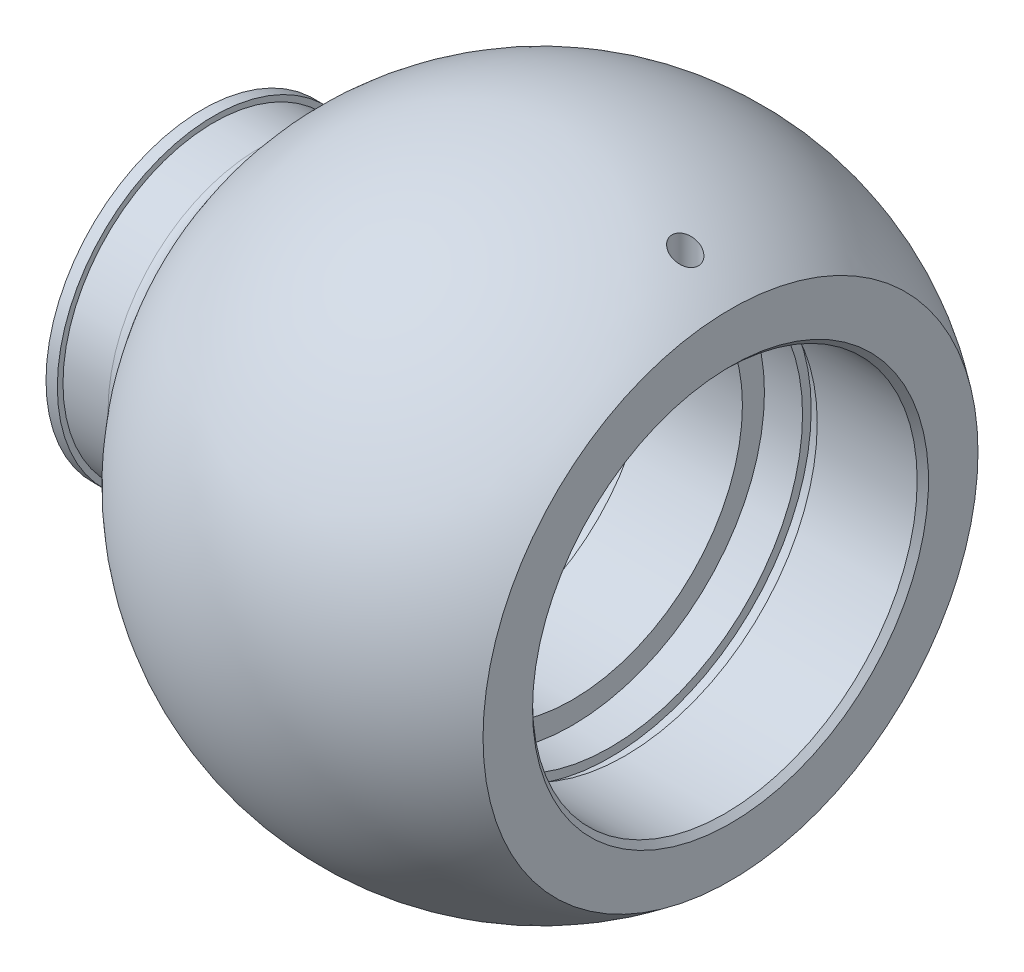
ISO-10303-21;
HEADER;
FILE_DESCRIPTION(('STEP AP214'),'2;1');
FILE_NAME('part.step','',(''),(''),'','','');
FILE_SCHEMA(('AUTOMOTIVE_DESIGN { 1 0 10303 214 1 1 1 1 }'));
ENDSEC;
DATA;
#1=APPLICATION_CONTEXT('core data for automotive mechanical design processes');
#2=APPLICATION_PROTOCOL_DEFINITION('international standard','automotive_design',2000,#1);
#3=PRODUCT_CONTEXT('',#1,'mechanical');
#4=PRODUCT('Part','Part','',(#3));
#5=PRODUCT_RELATED_PRODUCT_CATEGORY('part','',(#4));
#6=PRODUCT_DEFINITION_FORMATION('','',#4);
#7=PRODUCT_DEFINITION_CONTEXT('part definition',#1,'design');
#8=PRODUCT_DEFINITION('design','',#6,#7);
#9=PRODUCT_DEFINITION_SHAPE('','',#8);
#10=(LENGTH_UNIT() NAMED_UNIT(*) SI_UNIT(.MILLI.,.METRE.));
#11=(NAMED_UNIT(*) PLANE_ANGLE_UNIT() SI_UNIT($,.RADIAN.));
#12=(NAMED_UNIT(*) SI_UNIT($,.STERADIAN.) SOLID_ANGLE_UNIT());
#13=UNCERTAINTY_MEASURE_WITH_UNIT(LENGTH_MEASURE(1.E-05),#10,'distance_accuracy_value','');
#14=(GEOMETRIC_REPRESENTATION_CONTEXT(3) GLOBAL_UNCERTAINTY_ASSIGNED_CONTEXT((#13)) GLOBAL_UNIT_ASSIGNED_CONTEXT((#10,
#11,#12)) REPRESENTATION_CONTEXT('',''));
#15=CARTESIAN_POINT('',(0.,0.,0.));
#16=DIRECTION('',(0.,0.,1.));
#17=DIRECTION('',(1.,0.,0.));
#18=AXIS2_PLACEMENT_3D('',#15,#16,#17);
#19=CARTESIAN_POINT('',(90.,0.,0.));
#20=DIRECTION('',(-1.,0.,0.));
#21=DIRECTION('',(0.,1.,0.));
#22=AXIS2_PLACEMENT_3D('',#19,#20,#21);
#23=SPHERICAL_SURFACE('',#22,82.5);
#24=CARTESIAN_POINT('',(140.,0.,0.));
#25=DIRECTION('',(-1.,0.,0.));
#26=DIRECTION('',(0.,0.,1.));
#27=AXIS2_PLACEMENT_3D('',#24,#25,#26);
#28=CIRCLE('',#27,65.6220237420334);
#29=CARTESIAN_POINT('',(140.,0.,65.6220237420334));
#30=VERTEX_POINT('',#29);
#31=EDGE_CURVE('E122',#30,#30,#28,.T.);
#32=ORIENTED_EDGE('',*,*,#31,.T.);
#33=EDGE_LOOP('',(#32));
#34=FACE_BOUND('',#33,.T.);
#35=CARTESIAN_POINT('',(19.2464394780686,0.,0.));
#36=DIRECTION('',(-1.,0.,0.));
#37=DIRECTION('',(0.,0.,1.));
#38=AXIS2_PLACEMENT_3D('',#35,#36,#37);
#39=CIRCLE('',#38,42.4285714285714);
#40=CARTESIAN_POINT('',(19.2464394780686,0.,42.4285714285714));
#41=VERTEX_POINT('',#40);
#42=EDGE_CURVE('E10',#41,#41,#39,.T.);
#43=ORIENTED_EDGE('',*,*,#42,.F.);
#44=EDGE_LOOP('',(#43));
#45=FACE_BOUND('',#44,.T.);
#46=CARTESIAN_POINT('',(131.016095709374,71.5596026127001,-1.77571581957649));
#47=CARTESIAN_POINT('',(130.964479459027,71.587012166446,-1.86338589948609));
#48=CARTESIAN_POINT('',(130.909284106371,71.6163065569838,-1.94838180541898));
#49=CARTESIAN_POINT('',(130.792407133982,71.6782953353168,-2.11249458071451));
#50=CARTESIAN_POINT('',(130.730721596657,71.7109917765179,-2.19160784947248));
#51=CARTESIAN_POINT('',(130.536636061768,71.8137893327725,-2.41977834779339));
#52=CARTESIAN_POINT('',(130.395366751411,71.8885138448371,-2.55939889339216));
#53=CARTESIAN_POINT('',(130.095574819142,72.0468080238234,-2.81009307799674));
#54=CARTESIAN_POINT('',(129.937149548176,72.1303277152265,-2.9213168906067));
#55=CARTESIAN_POINT('',(129.607134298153,72.3039786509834,-3.11507706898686));
#56=CARTESIAN_POINT('',(129.435550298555,72.3941068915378,-3.19762637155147));
#57=CARTESIAN_POINT('',(129.066841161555,72.5873973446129,-3.33983116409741));
#58=CARTESIAN_POINT('',(128.868830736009,72.6909886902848,-3.39660830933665));
#59=CARTESIAN_POINT('',(128.467154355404,72.900667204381,-3.47471935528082));
#60=CARTESIAN_POINT('',(128.263485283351,73.0067557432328,-3.49603331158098));
#61=CARTESIAN_POINT('',(127.840478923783,73.2266108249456,-3.5032102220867));
#62=CARTESIAN_POINT('',(127.621085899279,73.3403710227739,-3.48636431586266));
#63=CARTESIAN_POINT('',(127.187657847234,73.5646014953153,-3.4115272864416));
#64=CARTESIAN_POINT('',(126.973623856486,73.6750711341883,-3.35352826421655));
#65=CARTESIAN_POINT('',(126.557333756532,73.8894721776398,-3.19657324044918));
#66=CARTESIAN_POINT('',(126.355076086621,73.9934044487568,-3.09762268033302));
#67=CARTESIAN_POINT('',(126.06629875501,74.1415117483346,-2.91952889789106));
#68=CARTESIAN_POINT('',(125.972430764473,74.1896046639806,-2.85517961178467));
#69=CARTESIAN_POINT('',(125.790500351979,74.2827310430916,-2.71682606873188));
#70=CARTESIAN_POINT('',(125.702434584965,74.3277662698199,-2.64282744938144));
#71=CARTESIAN_POINT('',(125.539615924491,74.4109587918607,-2.49156579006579));
#72=CARTESIAN_POINT('',(125.464360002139,74.4493786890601,-2.41498748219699));
#73=CARTESIAN_POINT('',(125.320526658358,74.5227570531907,-2.25433718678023));
#74=CARTESIAN_POINT('',(125.251945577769,74.5577174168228,-2.17026935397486));
#75=CARTESIAN_POINT('',(125.122298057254,74.6237659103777,-1.99516763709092));
#76=CARTESIAN_POINT('',(125.061228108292,74.6548558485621,-1.90413703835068));
#77=CARTESIAN_POINT('',(124.94740353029,74.7127711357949,-1.71573936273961));
#78=CARTESIAN_POINT('',(124.894647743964,74.7395970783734,-1.61837317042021));
#79=CARTESIAN_POINT('',(124.803904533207,74.7857187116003,-1.4298929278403));
#80=CARTESIAN_POINT('',(124.764910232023,74.8055288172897,-1.33938818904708));
#81=CARTESIAN_POINT('',(124.694500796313,74.8412871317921,-1.15474410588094));
#82=CARTESIAN_POINT('',(124.663084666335,74.8572358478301,-1.06060524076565));
#83=CARTESIAN_POINT('',(124.608265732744,74.8850585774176,-0.869491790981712));
#84=CARTESIAN_POINT('',(124.584858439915,74.8969348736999,-0.772518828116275));
#85=CARTESIAN_POINT('',(124.546364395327,74.9164628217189,-0.576517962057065));
#86=CARTESIAN_POINT('',(124.531277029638,74.9241147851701,-0.477490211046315));
#87=CARTESIAN_POINT('',(124.510682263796,74.9345592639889,-0.287860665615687));
#88=CARTESIAN_POINT('',(124.504392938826,74.9377484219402,-0.197364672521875));
#89=CARTESIAN_POINT('',(124.498861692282,74.9405531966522,-0.0160697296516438));
#90=CARTESIAN_POINT('',(124.499622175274,74.9401675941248,0.074729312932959));
#91=CARTESIAN_POINT('',(124.508188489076,74.9358237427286,0.255858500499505));
#92=CARTESIAN_POINT('',(124.51599009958,74.9318676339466,0.346188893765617));
#93=CARTESIAN_POINT('',(124.538529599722,74.920436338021,0.525764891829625));
#94=CARTESIAN_POINT('',(124.553270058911,74.9129598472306,0.615010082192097));
#95=CARTESIAN_POINT('',(124.606586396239,74.8859116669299,0.874800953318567));
#96=CARTESIAN_POINT('',(124.654548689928,74.8615737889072,1.04304178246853));
#97=CARTESIAN_POINT('',(124.77397275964,74.8009289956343,1.36852817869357));
#98=CARTESIAN_POINT('',(124.84543728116,74.7646206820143,1.52577245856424));
#99=CARTESIAN_POINT('',(125.012531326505,74.6796457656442,1.83212841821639));
#100=CARTESIAN_POINT('',(125.109034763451,74.6305318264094,1.98063855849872));
#101=CARTESIAN_POINT('',(125.321118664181,74.5224657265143,2.25926818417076));
#102=CARTESIAN_POINT('',(125.436705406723,74.4635103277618,2.38938159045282));
#103=CARTESIAN_POINT('',(125.694663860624,74.331758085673,2.64019861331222));
#104=CARTESIAN_POINT('',(125.838514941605,74.2581903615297,2.75897356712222));
#105=CARTESIAN_POINT('',(126.140373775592,74.1035598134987,2.97083132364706));
#106=CARTESIAN_POINT('',(126.298387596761,74.022493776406,3.06390304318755));
#107=CARTESIAN_POINT('',(126.642325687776,73.8457301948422,3.23221891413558));
#108=CARTESIAN_POINT('',(126.829415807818,73.7494005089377,3.30441977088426));
#109=CARTESIAN_POINT('',(127.211056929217,73.5524940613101,3.41571809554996));
#110=CARTESIAN_POINT('',(127.405611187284,73.4519154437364,3.45480093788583));
#111=CARTESIAN_POINT('',(127.815065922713,73.2397924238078,3.50170390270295));
#112=CARTESIAN_POINT('',(128.030234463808,73.1280695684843,3.50642756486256));
#113=CARTESIAN_POINT('',(128.4582145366,72.9053367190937,3.47651004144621));
#114=CARTESIAN_POINT('',(128.671025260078,72.7943269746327,3.44185575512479));
#115=CARTESIAN_POINT('',(129.095199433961,72.5725669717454,3.33165809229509));
#116=CARTESIAN_POINT('',(129.3063099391,72.4619331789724,3.25487104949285));
#117=CARTESIAN_POINT('',(129.611179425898,72.301820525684,3.10915500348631));
#118=CARTESIAN_POINT('',(129.710893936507,72.2493923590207,3.05545151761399));
#119=CARTESIAN_POINT('',(129.905516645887,72.1469565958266,2.9380094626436));
#120=CARTESIAN_POINT('',(130.000427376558,72.0969477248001,2.87427625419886));
#121=CARTESIAN_POINT('',(130.179974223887,72.0022506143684,2.74037186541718));
#122=CARTESIAN_POINT('',(130.26488591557,71.957421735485,2.67066916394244));
#123=CARTESIAN_POINT('',(130.428585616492,71.8709215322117,2.52272327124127));
#124=CARTESIAN_POINT('',(130.50737703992,71.8292484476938,2.44448490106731));
#125=CARTESIAN_POINT('',(130.657938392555,71.7495524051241,2.27986865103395));
#126=CARTESIAN_POINT('',(130.729710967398,71.7115280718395,2.19349386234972));
#127=CARTESIAN_POINT('',(130.865321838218,71.6396317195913,2.01312091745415));
#128=CARTESIAN_POINT('',(130.929161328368,71.6057590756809,1.91912391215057));
#129=CARTESIAN_POINT('',(131.041171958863,71.5462906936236,1.73536513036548));
#130=CARTESIAN_POINT('',(131.090300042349,71.5201913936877,1.64634859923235));
#131=CARTESIAN_POINT('',(131.180970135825,71.4720004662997,1.46350193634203));
#132=CARTESIAN_POINT('',(131.222513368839,71.4499081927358,1.36967258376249));
#133=CARTESIAN_POINT('',(131.297408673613,71.4100646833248,1.17799626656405));
#134=CARTESIAN_POINT('',(131.330767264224,71.3923099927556,1.08015257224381));
#135=CARTESIAN_POINT('',(131.388830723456,71.3613978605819,0.881225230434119));
#136=CARTESIAN_POINT('',(131.413536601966,71.3482398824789,0.780141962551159));
#137=CARTESIAN_POINT('',(131.451509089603,71.3280127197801,0.587812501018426));
#138=CARTESIAN_POINT('',(131.465784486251,71.3204066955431,0.496820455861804));
#139=CARTESIAN_POINT('',(131.487130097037,71.3090327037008,0.313721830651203));
#140=CARTESIAN_POINT('',(131.494197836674,71.3052660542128,0.221614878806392));
#141=CARTESIAN_POINT('',(131.501020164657,71.301630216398,0.0370840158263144));
#142=CARTESIAN_POINT('',(131.500777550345,71.3017595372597,-0.0553397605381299));
#143=CARTESIAN_POINT('',(131.492997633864,71.3059056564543,-0.239802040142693));
#144=CARTESIAN_POINT('',(131.485457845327,71.3099237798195,-0.331840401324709));
#145=CARTESIAN_POINT('',(131.453252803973,71.3270841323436,-0.596014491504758));
#146=CARTESIAN_POINT('',(131.419330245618,71.3451576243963,-0.766803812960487));
#147=CARTESIAN_POINT('',(131.327297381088,71.3941593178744,-1.09948010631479));
#148=CARTESIAN_POINT('',(131.269222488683,71.4250686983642,-1.26137972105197));
#149=CARTESIAN_POINT('',(131.172953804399,71.4762598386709,-1.47883916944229));
#150=CARTESIAN_POINT('',(131.143842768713,71.4917352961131,-1.53973432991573));
#151=CARTESIAN_POINT('',(131.082367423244,71.524403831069,-1.65937596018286));
#152=CARTESIAN_POINT('',(131.050003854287,71.5415965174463,-1.71812291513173));
#153=CARTESIAN_POINT('',(131.016095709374,71.5596026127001,-1.77571581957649));
#154=B_SPLINE_CURVE_WITH_KNOTS('',3,(#46,#47,#48,#49,#50,#51,#52,#53,#54,#55,#56,#57,#58,#59,
#60,#61,#62,#63,#64,#65,#66,#67,#68,#69,#70,#71,#72,#73,#74,#75,#76,#77,#78,#79,#80,#81,#82,#83,
#84,#85,#86,#87,#88,#89,#90,#91,#92,#93,#94,#95,#96,#97,#98,#99,#100,#101,#102,#103,#104,#105,
#106,#107,#108,#109,#110,#111,#112,#113,#114,#115,#116,#117,#118,#119,#120,#121,#122,#123,#124,
#125,#126,#127,#128,#129,#130,#131,#132,#133,#134,#135,#136,#137,#138,#139,#140,#141,#142,#143,
#144,#145,#146,#147,#148,#149,#150,#151,#152,#153),.UNSPECIFIED.,.T.,.F.,(4,2,2,2,2,2,2,2,2,2,2,
2,2,2,2,2,2,2,2,2,2,2,2,2,2,2,2,2,2,2,2,2,2,2,2,2,2,2,2,2,2,2,2,2,2,2,2,2,2,2,2,2,2,4),(0.,
0.31600930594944,0.632210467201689,1.26556786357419,1.89550298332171,2.5251535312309,
3.21394074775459,3.90311520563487,4.64273083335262,5.38248846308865,6.12214782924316,
6.49235190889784,6.86234065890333,7.20397595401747,7.54542289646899,7.88670971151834,
8.22794897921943,8.52909927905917,8.83020999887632,9.13115165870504,9.43207110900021,
9.70404403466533,9.97610972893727,10.2480124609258,10.520015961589,11.0472940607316,
11.5746337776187,12.123688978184,12.6729251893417,13.27205724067,13.8714472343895,
14.5360811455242,15.2010084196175,15.9251925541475,16.649617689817,17.3966759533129,
17.7706630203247,18.1444508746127,18.4999232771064,18.8551959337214,19.2103341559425,
19.5654188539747,19.8798904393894,20.1943112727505,20.508480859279,20.8226137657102,
21.0995129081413,21.3765070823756,21.6533952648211,21.9303778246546,22.4529767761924,
22.9748121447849,23.1824546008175,23.3900498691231),.UNSPECIFIED.);
#155=CARTESIAN_POINT('',(131.016095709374,71.5596026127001,-1.77571581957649));
#156=VERTEX_POINT('',#155);
#157=EDGE_CURVE('E125',#156,#156,#154,.T.);
#158=ORIENTED_EDGE('',*,*,#157,.F.);
#159=EDGE_LOOP('',(#158));
#160=FACE_BOUND('',#159,.T.);
#161=ADVANCED_FACE('F32',(#34,#45,#160),#23,.T.);
#162=CARTESIAN_POINT('',(-14.501348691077,0.,0.));
#163=DIRECTION('',(-1.,0.,0.));
#164=DIRECTION('',(0.,0.,1.));
#165=AXIS2_PLACEMENT_3D('',#162,#163,#164);
#166=CYLINDRICAL_SURFACE('',#165,51.);
#167=CARTESIAN_POINT('',(112.,0.,0.));
#168=DIRECTION('',(-1.,0.,0.));
#169=DIRECTION('',(0.,0.,1.));
#170=AXIS2_PLACEMENT_3D('',#167,#168,#169);
#171=CIRCLE('',#170,51.);
#172=CARTESIAN_POINT('',(112.,0.,51.));
#173=VERTEX_POINT('',#172);
#174=EDGE_CURVE('E113',#173,#173,#171,.T.);
#175=ORIENTED_EDGE('',*,*,#174,.T.);
#176=EDGE_LOOP('',(#175));
#177=FACE_BOUND('',#176,.T.);
#178=CARTESIAN_POINT('',(138.5,0.,0.));
#179=DIRECTION('',(-1.,0.,0.));
#180=DIRECTION('',(0.,0.,1.));
#181=AXIS2_PLACEMENT_3D('',#178,#179,#180);
#182=CIRCLE('',#181,51.);
#183=CARTESIAN_POINT('',(138.5,0.,51.));
#184=VERTEX_POINT('',#183);
#185=EDGE_CURVE('E116',#184,#184,#182,.T.);
#186=ORIENTED_EDGE('',*,*,#185,.F.);
#187=EDGE_LOOP('',(#186));
#188=FACE_BOUND('',#187,.T.);
#189=CARTESIAN_POINT('',(128.,50.8797602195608,-3.49999999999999));
#190=CARTESIAN_POINT('',(128.196348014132,50.8797618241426,-3.4999913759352));
#191=CARTESIAN_POINT('',(128.392832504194,50.8809090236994,-3.48342194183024));
#192=CARTESIAN_POINT('',(128.780373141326,50.8853742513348,-3.41756267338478));
#193=CARTESIAN_POINT('',(128.971422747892,50.8886947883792,-3.36823502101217));
#194=CARTESIAN_POINT('',(129.342424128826,50.8971288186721,-3.23828544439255));
#195=CARTESIAN_POINT('',(129.522381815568,50.9022413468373,-3.15768036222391));
#196=CARTESIAN_POINT('',(129.866167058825,50.913682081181,-2.96749200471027));
#197=CARTESIAN_POINT('',(130.029998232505,50.920010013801,-2.85791524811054));
#198=CARTESIAN_POINT('',(130.337218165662,50.9331812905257,-2.61268079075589));
#199=CARTESIAN_POINT('',(130.480574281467,50.9400254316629,-2.476982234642));
#200=CARTESIAN_POINT('',(130.742495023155,50.9534505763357,-2.18344124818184));
#201=CARTESIAN_POINT('',(130.861058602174,50.9600315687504,-2.02559788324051));
#202=CARTESIAN_POINT('',(131.070131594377,50.9721959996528,-1.6920603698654));
#203=CARTESIAN_POINT('',(131.160613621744,50.9777784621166,-1.51634901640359));
#204=CARTESIAN_POINT('',(131.310779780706,50.9873083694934,-1.15218380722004));
#205=CARTESIAN_POINT('',(131.370464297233,50.9912558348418,-0.963730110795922));
#206=CARTESIAN_POINT('',(131.457249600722,50.9970654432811,-0.579747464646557));
#207=CARTESIAN_POINT('',(131.484402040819,50.998930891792,-0.384230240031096));
#208=CARTESIAN_POINT('',(131.505511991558,51.0003774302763,0.00859501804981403));
#209=CARTESIAN_POINT('',(131.49946994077,50.9999585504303,0.205903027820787));
#210=CARTESIAN_POINT('',(131.454404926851,50.9968863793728,0.596359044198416));
#211=CARTESIAN_POINT('',(131.415437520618,50.9942368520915,0.789513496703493));
#212=CARTESIAN_POINT('',(131.30571419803,50.9870059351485,1.16653342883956));
#213=CARTESIAN_POINT('',(131.234958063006,50.9824245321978,1.35039884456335));
#214=CARTESIAN_POINT('',(131.063603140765,50.9718391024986,1.70379937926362));
#215=CARTESIAN_POINT('',(130.962979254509,50.9658338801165,1.87332229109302));
#216=CARTESIAN_POINT('',(130.734763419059,50.9530763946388,2.19309239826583));
#217=CARTESIAN_POINT('',(130.607171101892,50.9463241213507,2.34333933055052));
#218=CARTESIAN_POINT('',(130.328326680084,50.9328157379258,2.62061693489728));
#219=CARTESIAN_POINT('',(130.17702633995,50.9260596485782,2.74759910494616));
#220=CARTESIAN_POINT('',(129.855229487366,50.9133192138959,2.97436847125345));
#221=CARTESIAN_POINT('',(129.684732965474,50.9073348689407,3.07415565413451));
#222=CARTESIAN_POINT('',(129.329351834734,50.8968139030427,3.24369942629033));
#223=CARTESIAN_POINT('',(129.144466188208,50.8922773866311,3.31345384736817));
#224=CARTESIAN_POINT('',(128.765569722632,50.8851672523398,3.42091789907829));
#225=CARTESIAN_POINT('',(128.571559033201,50.8825936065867,3.45862798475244));
#226=CARTESIAN_POINT('',(128.180343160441,50.8797047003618,3.50087223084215));
#227=CARTESIAN_POINT('',(127.983145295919,50.8793848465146,3.50547386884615));
#228=CARTESIAN_POINT('',(127.590780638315,50.8810275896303,3.48154701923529));
#229=CARTESIAN_POINT('',(127.395613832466,50.8829901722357,3.45301874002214));
#230=CARTESIAN_POINT('',(127.013042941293,50.8889724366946,3.36369797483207));
#231=CARTESIAN_POINT('',(126.825631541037,50.8929901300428,3.30293667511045));
#232=CARTESIAN_POINT('',(126.463665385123,50.9026282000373,3.15090627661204));
#233=CARTESIAN_POINT('',(126.289110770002,50.9082485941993,3.05963684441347));
#234=CARTESIAN_POINT('',(125.957503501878,50.9204698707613,2.84900899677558));
#235=CARTESIAN_POINT('',(125.800479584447,50.9270723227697,2.72960543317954));
#236=CARTESIAN_POINT('',(125.508680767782,50.940508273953,2.46616432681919));
#237=CARTESIAN_POINT('',(125.373906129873,50.9473417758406,2.32212649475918));
#238=CARTESIAN_POINT('',(125.130203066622,50.9604833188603,2.01321482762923));
#239=CARTESIAN_POINT('',(125.02131835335,50.9667904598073,1.84830646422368));
#240=CARTESIAN_POINT('',(124.832785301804,50.9781556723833,1.5025080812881));
#241=CARTESIAN_POINT('',(124.753136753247,50.9832137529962,1.32161817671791));
#242=CARTESIAN_POINT('',(124.625412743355,50.9915066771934,0.949151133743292));
#243=CARTESIAN_POINT('',(124.577309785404,50.9947431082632,0.757583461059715));
#244=CARTESIAN_POINT('',(124.513952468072,50.9990344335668,0.369067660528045));
#245=CARTESIAN_POINT('',(124.498697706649,51.0000893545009,0.172119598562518));
#246=CARTESIAN_POINT('',(124.501473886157,50.9998988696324,-0.221134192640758));
#247=CARTESIAN_POINT('',(124.519436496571,50.99865818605,-0.417440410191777));
#248=CARTESIAN_POINT('',(124.587995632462,50.9940253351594,-0.804242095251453));
#249=CARTESIAN_POINT('',(124.638592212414,50.9906331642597,-0.994737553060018));
#250=CARTESIAN_POINT('',(124.770967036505,50.9820784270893,-1.36451883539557));
#251=CARTESIAN_POINT('',(124.852744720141,50.9769158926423,-1.54380486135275));
#252=CARTESIAN_POINT('',(125.045151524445,50.9653995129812,-1.88611201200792));
#253=CARTESIAN_POINT('',(125.155779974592,50.9590456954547,-2.04913351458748));
#254=CARTESIAN_POINT('',(125.403002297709,50.9458455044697,-2.35463189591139));
#255=CARTESIAN_POINT('',(125.539646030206,50.9389982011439,-2.4970683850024));
#256=CARTESIAN_POINT('',(125.83494427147,50.9255904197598,-2.75703335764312));
#257=CARTESIAN_POINT('',(125.993604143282,50.9190300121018,-2.8745557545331));
#258=CARTESIAN_POINT('',(126.328645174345,50.9069286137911,-3.08146221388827));
#259=CARTESIAN_POINT('',(126.505050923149,50.9013890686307,-3.17080650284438));
#260=CARTESIAN_POINT('',(126.870271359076,50.8919748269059,-3.31849754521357));
#261=CARTESIAN_POINT('',(127.059071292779,50.8880981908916,-3.37688042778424));
#262=CARTESIAN_POINT('',(127.374179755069,50.8834596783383,-3.44589738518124));
#263=CARTESIAN_POINT('',(127.498453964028,50.8820786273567,-3.46615943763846));
#264=CARTESIAN_POINT('',(127.748466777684,50.880228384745,-3.49321349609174));
#265=CARTESIAN_POINT('',(127.87420537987,50.8797591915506,-3.50000552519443));
#266=CARTESIAN_POINT('',(128.,50.8797602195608,-3.49999999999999));
#267=B_SPLINE_CURVE_WITH_KNOTS('',3,(#189,#190,#191,#192,#193,#194,#195,#196,#197,#198,#199,
#200,#201,#202,#203,#204,#205,#206,#207,#208,#209,#210,#211,#212,#213,#214,#215,#216,#217,#218,
#219,#220,#221,#222,#223,#224,#225,#226,#227,#228,#229,#230,#231,#232,#233,#234,#235,#236,#237,
#238,#239,#240,#241,#242,#243,#244,#245,#246,#247,#248,#249,#250,#251,#252,#253,#254,#255,#256,
#257,#258,#259,#260,#261,#262,#263,#264,#265,#266),.UNSPECIFIED.,.T.,.F.,(4,2,2,2,2,2,2,2,2,2,2,
2,2,2,2,2,2,2,2,2,2,2,2,2,2,2,2,2,2,2,2,2,2,2,2,2,2,2,4),(0.,0.588584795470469,1.1778502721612,
1.76679888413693,2.35561509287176,2.94535982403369,3.53512945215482,4.12547244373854,
4.71580805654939,5.30520511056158,5.89459437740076,6.482991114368,7.07139189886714,
7.66028854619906,8.24919322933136,8.83931201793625,9.429431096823,10.0195927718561,
10.6097460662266,11.1986962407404,11.7876427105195,12.3760203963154,12.9644045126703,
13.5537393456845,14.1430811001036,14.7334109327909,15.3237365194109,15.9135468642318,
16.5033499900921,17.0919411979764,17.6805333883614,18.269114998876,18.8576829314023,
19.4473904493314,20.0372418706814,20.6279221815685,21.2179116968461,21.5950019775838,
21.9720916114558),.UNSPECIFIED.);
#268=CARTESIAN_POINT('',(128.,50.8797602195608,-3.49999999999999));
#269=VERTEX_POINT('',#268);
#270=EDGE_CURVE('E36',#269,#269,#267,.T.);
#271=ORIENTED_EDGE('',*,*,#270,.F.);
#272=EDGE_LOOP('',(#271));
#273=FACE_BOUND('',#272,.T.);
#274=ADVANCED_FACE('F143',(#177,#188,#273),#166,.F.);
#275=CARTESIAN_POINT('',(14.9583449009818,0.,0.));
#276=DIRECTION('',(-1.,0.,0.));
#277=DIRECTION('',(0.,0.,1.));
#278=AXIS2_PLACEMENT_3D('',#275,#276,#277);
#279=TOROIDAL_SURFACE('',#278,45.,5.);
#280=CARTESIAN_POINT('',(14.9583449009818,0.,0.));
#281=DIRECTION('',(-1.,0.,0.));
#282=DIRECTION('',(0.,0.,1.));
#283=AXIS2_PLACEMENT_3D('',#280,#281,#282);
#284=CIRCLE('',#283,40.);
#285=CARTESIAN_POINT('',(14.9583449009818,0.,40.));
#286=VERTEX_POINT('',#285);
#287=EDGE_CURVE('E44',#286,#286,#284,.T.);
#288=ORIENTED_EDGE('',*,*,#287,.F.);
#289=EDGE_LOOP('',(#288));
#290=FACE_BOUND('',#289,.T.);
#291=ORIENTED_EDGE('',*,*,#42,.T.);
#292=EDGE_LOOP('',(#291));
#293=FACE_BOUND('',#292,.T.);
#294=ADVANCED_FACE('F147',(#290,#293),#279,.F.);
#295=CARTESIAN_POINT('',(-14.501348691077,0.,0.));
#296=DIRECTION('',(-1.,0.,0.));
#297=DIRECTION('',(0.,0.,1.));
#298=AXIS2_PLACEMENT_3D('',#295,#296,#297);
#299=CYLINDRICAL_SURFACE('',#298,40.);
#300=CARTESIAN_POINT('',(3.,0.,0.));
#301=DIRECTION('',(-1.,0.,0.));
#302=DIRECTION('',(0.,0.,1.));
#303=AXIS2_PLACEMENT_3D('',#300,#301,#302);
#304=CIRCLE('',#303,40.);
#305=CARTESIAN_POINT('',(3.,0.,40.));
#306=VERTEX_POINT('',#305);
#307=EDGE_CURVE('E48',#306,#306,#304,.T.);
#308=ORIENTED_EDGE('',*,*,#307,.F.);
#309=EDGE_LOOP('',(#308));
#310=FACE_BOUND('',#309,.T.);
#311=ORIENTED_EDGE('',*,*,#287,.T.);
#312=EDGE_LOOP('',(#311));
#313=FACE_BOUND('',#312,.T.);
#314=ADVANCED_FACE('F231',(#310,#313),#299,.T.);
#315=CARTESIAN_POINT('',(3.,41.5,0.));
#316=DIRECTION('',(-1.,0.,0.));
#317=DIRECTION('',(0.,0.,1.));
#318=AXIS2_PLACEMENT_3D('',#315,#316,#317);
#319=PLANE('',#318);
#320=CARTESIAN_POINT('',(3.,0.,0.));
#321=DIRECTION('',(-1.,0.,0.));
#322=DIRECTION('',(0.,0.,1.));
#323=AXIS2_PLACEMENT_3D('',#320,#321,#322);
#324=CIRCLE('',#323,41.5);
#325=CARTESIAN_POINT('',(3.,0.,41.5));
#326=VERTEX_POINT('',#325);
#327=EDGE_CURVE('E53',#326,#326,#324,.T.);
#328=ORIENTED_EDGE('',*,*,#327,.F.);
#329=EDGE_LOOP('',(#328));
#330=FACE_BOUND('',#329,.T.);
#331=ORIENTED_EDGE('',*,*,#307,.T.);
#332=EDGE_LOOP('',(#331));
#333=FACE_BOUND('',#332,.T.);
#334=ADVANCED_FACE('F227',(#330,#333),#319,.F.);
#335=CARTESIAN_POINT('',(-14.501348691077,0.,0.));
#336=DIRECTION('',(-1.,0.,0.));
#337=DIRECTION('',(0.,0.,1.));
#338=AXIS2_PLACEMENT_3D('',#335,#336,#337);
#339=CYLINDRICAL_SURFACE('',#338,41.5);
#340=CARTESIAN_POINT('',(0.,0.,0.));
#341=DIRECTION('',(-1.,0.,0.));
#342=DIRECTION('',(0.,0.,1.));
#343=AXIS2_PLACEMENT_3D('',#340,#341,#342);
#344=CIRCLE('',#343,41.5);
#345=CARTESIAN_POINT('',(0.,0.,41.5));
#346=VERTEX_POINT('',#345);
#347=EDGE_CURVE('E56',#346,#346,#344,.T.);
#348=ORIENTED_EDGE('',*,*,#347,.F.);
#349=EDGE_LOOP('',(#348));
#350=FACE_BOUND('',#349,.T.);
#351=ORIENTED_EDGE('',*,*,#327,.T.);
#352=EDGE_LOOP('',(#351));
#353=FACE_BOUND('',#352,.T.);
#354=ADVANCED_FACE('F223',(#350,#353),#339,.T.);
#355=CARTESIAN_POINT('',(0.,41.5,0.));
#356=DIRECTION('',(1.,0.,0.));
#357=DIRECTION('',(0.,0.,-1.));
#358=AXIS2_PLACEMENT_3D('',#355,#356,#357);
#359=PLANE('',#358);
#360=CARTESIAN_POINT('',(0.,0.,0.));
#361=DIRECTION('',(-1.,0.,0.));
#362=DIRECTION('',(0.,0.,1.));
#363=AXIS2_PLACEMENT_3D('',#360,#361,#362);
#364=CIRCLE('',#363,27.75);
#365=CARTESIAN_POINT('',(0.,0.,27.75));
#366=VERTEX_POINT('',#365);
#367=EDGE_CURVE('E59',#366,#366,#364,.T.);
#368=ORIENTED_EDGE('',*,*,#367,.F.);
#369=EDGE_LOOP('',(#368));
#370=FACE_BOUND('',#369,.T.);
#371=ORIENTED_EDGE('',*,*,#347,.T.);
#372=EDGE_LOOP('',(#371));
#373=FACE_BOUND('',#372,.T.);
#374=ADVANCED_FACE('F219',(#370,#373),#359,.F.);
#375=CARTESIAN_POINT('',(-14.501348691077,0.,0.));
#376=DIRECTION('',(-1.,0.,0.));
#377=DIRECTION('',(0.,0.,1.));
#378=AXIS2_PLACEMENT_3D('',#375,#376,#377);
#379=CYLINDRICAL_SURFACE('',#378,27.75);
#380=CARTESIAN_POINT('',(2.,0.,0.));
#381=DIRECTION('',(-1.,0.,0.));
#382=DIRECTION('',(0.,0.,1.));
#383=AXIS2_PLACEMENT_3D('',#380,#381,#382);
#384=CIRCLE('',#383,27.75);
#385=CARTESIAN_POINT('',(2.,0.,27.75));
#386=VERTEX_POINT('',#385);
#387=EDGE_CURVE('E62',#386,#386,#384,.T.);
#388=ORIENTED_EDGE('',*,*,#387,.F.);
#389=EDGE_LOOP('',(#388));
#390=FACE_BOUND('',#389,.T.);
#391=ORIENTED_EDGE('',*,*,#367,.T.);
#392=EDGE_LOOP('',(#391));
#393=FACE_BOUND('',#392,.T.);
#394=ADVANCED_FACE('F215',(#390,#393),#379,.F.);
#395=CARTESIAN_POINT('',(2.,27.75,0.));
#396=DIRECTION('',(-1.,0.,0.));
#397=DIRECTION('',(0.,0.,1.));
#398=AXIS2_PLACEMENT_3D('',#395,#396,#397);
#399=PLANE('',#398);
#400=CARTESIAN_POINT('',(2.,0.,0.));
#401=DIRECTION('',(-1.,0.,0.));
#402=DIRECTION('',(0.,0.,1.));
#403=AXIS2_PLACEMENT_3D('',#400,#401,#402);
#404=CIRCLE('',#403,29.);
#405=CARTESIAN_POINT('',(2.,0.,29.));
#406=VERTEX_POINT('',#405);
#407=EDGE_CURVE('E65',#406,#406,#404,.T.);
#408=ORIENTED_EDGE('',*,*,#407,.F.);
#409=EDGE_LOOP('',(#408));
#410=FACE_BOUND('',#409,.T.);
#411=ORIENTED_EDGE('',*,*,#387,.T.);
#412=EDGE_LOOP('',(#411));
#413=FACE_BOUND('',#412,.T.);
#414=ADVANCED_FACE('F211',(#410,#413),#399,.F.);
#415=CARTESIAN_POINT('',(-14.501348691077,0.,0.));
#416=DIRECTION('',(-1.,0.,0.));
#417=DIRECTION('',(0.,0.,1.));
#418=AXIS2_PLACEMENT_3D('',#415,#416,#417);
#419=CYLINDRICAL_SURFACE('',#418,29.);
#420=CARTESIAN_POINT('',(6.99999999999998,0.,0.));
#421=DIRECTION('',(-1.,0.,0.));
#422=DIRECTION('',(0.,0.,1.));
#423=AXIS2_PLACEMENT_3D('',#420,#421,#422);
#424=CIRCLE('',#423,29.);
#425=CARTESIAN_POINT('',(6.99999999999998,0.,29.));
#426=VERTEX_POINT('',#425);
#427=EDGE_CURVE('E68',#426,#426,#424,.T.);
#428=ORIENTED_EDGE('',*,*,#427,.F.);
#429=EDGE_LOOP('',(#428));
#430=FACE_BOUND('',#429,.T.);
#431=ORIENTED_EDGE('',*,*,#407,.T.);
#432=EDGE_LOOP('',(#431));
#433=FACE_BOUND('',#432,.T.);
#434=ADVANCED_FACE('F207',(#430,#433),#419,.F.);
#435=CARTESIAN_POINT('',(6.99999999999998,25.,0.));
#436=DIRECTION('',(1.,0.,0.));
#437=DIRECTION('',(0.,0.,-1.));
#438=AXIS2_PLACEMENT_3D('',#435,#436,#437);
#439=PLANE('',#438);
#440=CARTESIAN_POINT('',(6.99999999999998,0.,0.));
#441=DIRECTION('',(-1.,0.,0.));
#442=DIRECTION('',(0.,0.,1.));
#443=AXIS2_PLACEMENT_3D('',#440,#441,#442);
#444=CIRCLE('',#443,25.);
#445=CARTESIAN_POINT('',(6.99999999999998,0.,25.));
#446=VERTEX_POINT('',#445);
#447=EDGE_CURVE('E71',#446,#446,#444,.T.);
#448=ORIENTED_EDGE('',*,*,#447,.F.);
#449=EDGE_LOOP('',(#448));
#450=FACE_BOUND('',#449,.T.);
#451=ORIENTED_EDGE('',*,*,#427,.T.);
#452=EDGE_LOOP('',(#451));
#453=FACE_BOUND('',#452,.T.);
#454=ADVANCED_FACE('F203',(#450,#453),#439,.F.);
#455=CARTESIAN_POINT('',(-14.501348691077,0.,0.));
#456=DIRECTION('',(-1.,0.,0.));
#457=DIRECTION('',(0.,0.,1.));
#458=AXIS2_PLACEMENT_3D('',#455,#456,#457);
#459=CYLINDRICAL_SURFACE('',#458,25.);
#460=CARTESIAN_POINT('',(12.,0.,0.));
#461=DIRECTION('',(-1.,0.,0.));
#462=DIRECTION('',(0.,0.,1.));
#463=AXIS2_PLACEMENT_3D('',#460,#461,#462);
#464=CIRCLE('',#463,25.);
#465=CARTESIAN_POINT('',(12.,0.,25.));
#466=VERTEX_POINT('',#465);
#467=EDGE_CURVE('E74',#466,#466,#464,.T.);
#468=ORIENTED_EDGE('',*,*,#467,.F.);
#469=EDGE_LOOP('',(#468));
#470=FACE_BOUND('',#469,.T.);
#471=ORIENTED_EDGE('',*,*,#447,.T.);
#472=EDGE_LOOP('',(#471));
#473=FACE_BOUND('',#472,.T.);
#474=ADVANCED_FACE('F199',(#470,#473),#459,.F.);
#475=CARTESIAN_POINT('',(12.,30.,0.));
#476=DIRECTION('',(-1.,0.,0.));
#477=DIRECTION('',(0.,0.,1.));
#478=AXIS2_PLACEMENT_3D('',#475,#476,#477);
#479=PLANE('',#478);
#480=CARTESIAN_POINT('',(12.0000000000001,0.,0.));
#481=DIRECTION('',(-1.,0.,0.));
#482=DIRECTION('',(0.,0.,1.));
#483=AXIS2_PLACEMENT_3D('',#480,#481,#482);
#484=CIRCLE('',#483,30.);
#485=CARTESIAN_POINT('',(12.0000000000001,0.,30.));
#486=VERTEX_POINT('',#485);
#487=EDGE_CURVE('E77',#486,#486,#484,.T.);
#488=ORIENTED_EDGE('',*,*,#487,.F.);
#489=EDGE_LOOP('',(#488));
#490=FACE_BOUND('',#489,.T.);
#491=ORIENTED_EDGE('',*,*,#467,.T.);
#492=EDGE_LOOP('',(#491));
#493=FACE_BOUND('',#492,.T.);
#494=ADVANCED_FACE('F195',(#490,#493),#479,.F.);
#495=CARTESIAN_POINT('',(-14.501348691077,0.,0.));
#496=DIRECTION('',(-1.,0.,0.));
#497=DIRECTION('',(0.,0.,1.));
#498=AXIS2_PLACEMENT_3D('',#495,#496,#497);
#499=CYLINDRICAL_SURFACE('',#498,30.);
#500=CARTESIAN_POINT('',(22.9999999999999,0.,0.));
#501=DIRECTION('',(-1.,0.,0.));
#502=DIRECTION('',(0.,0.,1.));
#503=AXIS2_PLACEMENT_3D('',#500,#501,#502);
#504=CIRCLE('',#503,30.);
#505=CARTESIAN_POINT('',(22.9999999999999,0.,30.));
#506=VERTEX_POINT('',#505);
#507=EDGE_CURVE('E80',#506,#506,#504,.T.);
#508=ORIENTED_EDGE('',*,*,#507,.F.);
#509=EDGE_LOOP('',(#508));
#510=FACE_BOUND('',#509,.T.);
#511=ORIENTED_EDGE('',*,*,#487,.T.);
#512=EDGE_LOOP('',(#511));
#513=FACE_BOUND('',#512,.T.);
#514=ADVANCED_FACE('F191',(#510,#513),#499,.F.);
#515=CARTESIAN_POINT('',(23.,30.,0.));
#516=DIRECTION('',(1.,0.,0.));
#517=DIRECTION('',(0.,0.,-1.));
#518=AXIS2_PLACEMENT_3D('',#515,#516,#517);
#519=PLANE('',#518);
#520=CARTESIAN_POINT('',(23.,0.,0.));
#521=DIRECTION('',(-1.,0.,0.));
#522=DIRECTION('',(0.,0.,1.));
#523=AXIS2_PLACEMENT_3D('',#520,#521,#522);
#524=CIRCLE('',#523,25.);
#525=CARTESIAN_POINT('',(23.,0.,25.));
#526=VERTEX_POINT('',#525);
#527=EDGE_CURVE('E83',#526,#526,#524,.T.);
#528=ORIENTED_EDGE('',*,*,#527,.F.);
#529=EDGE_LOOP('',(#528));
#530=FACE_BOUND('',#529,.T.);
#531=ORIENTED_EDGE('',*,*,#507,.T.);
#532=EDGE_LOOP('',(#531));
#533=FACE_BOUND('',#532,.T.);
#534=ADVANCED_FACE('F187',(#530,#533),#519,.F.);
#535=CARTESIAN_POINT('',(-14.501348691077,0.,0.));
#536=DIRECTION('',(-1.,0.,0.));
#537=DIRECTION('',(0.,0.,1.));
#538=AXIS2_PLACEMENT_3D('',#535,#536,#537);
#539=CYLINDRICAL_SURFACE('',#538,25.);
#540=CARTESIAN_POINT('',(68.,0.,0.));
#541=DIRECTION('',(-1.,0.,0.));
#542=DIRECTION('',(0.,0.,1.));
#543=AXIS2_PLACEMENT_3D('',#540,#541,#542);
#544=CIRCLE('',#543,25.);
#545=CARTESIAN_POINT('',(68.,0.,25.));
#546=VERTEX_POINT('',#545);
#547=EDGE_CURVE('E86',#546,#546,#544,.T.);
#548=ORIENTED_EDGE('',*,*,#547,.F.);
#549=EDGE_LOOP('',(#548));
#550=FACE_BOUND('',#549,.T.);
#551=ORIENTED_EDGE('',*,*,#527,.T.);
#552=EDGE_LOOP('',(#551));
#553=FACE_BOUND('',#552,.T.);
#554=ADVANCED_FACE('F183',(#550,#553),#539,.F.);
#555=CARTESIAN_POINT('',(68.,48.,0.));
#556=DIRECTION('',(-1.,0.,0.));
#557=DIRECTION('',(0.,0.,1.));
#558=AXIS2_PLACEMENT_3D('',#555,#556,#557);
#559=PLANE('',#558);
#560=CARTESIAN_POINT('',(68.,0.,0.));
#561=DIRECTION('',(-1.,0.,0.));
#562=DIRECTION('',(0.,0.,1.));
#563=AXIS2_PLACEMENT_3D('',#560,#561,#562);
#564=CIRCLE('',#563,48.);
#565=CARTESIAN_POINT('',(68.,0.,48.));
#566=VERTEX_POINT('',#565);
#567=EDGE_CURVE('E89',#566,#566,#564,.T.);
#568=ORIENTED_EDGE('',*,*,#567,.F.);
#569=EDGE_LOOP('',(#568));
#570=FACE_BOUND('',#569,.T.);
#571=ORIENTED_EDGE('',*,*,#547,.T.);
#572=EDGE_LOOP('',(#571));
#573=FACE_BOUND('',#572,.T.);
#574=ADVANCED_FACE('F179',(#570,#573),#559,.F.);
#575=CARTESIAN_POINT('',(-14.501348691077,0.,0.));
#576=DIRECTION('',(-1.,0.,0.));
#577=DIRECTION('',(0.,0.,1.));
#578=AXIS2_PLACEMENT_3D('',#575,#576,#577);
#579=CYLINDRICAL_SURFACE('',#578,48.);
#580=CARTESIAN_POINT('',(73.,0.,0.));
#581=DIRECTION('',(-1.,0.,0.));
#582=DIRECTION('',(0.,0.,1.));
#583=AXIS2_PLACEMENT_3D('',#580,#581,#582);
#584=CIRCLE('',#583,48.);
#585=CARTESIAN_POINT('',(73.,0.,48.));
#586=VERTEX_POINT('',#585);
#587=EDGE_CURVE('E92',#586,#586,#584,.T.);
#588=ORIENTED_EDGE('',*,*,#587,.F.);
#589=EDGE_LOOP('',(#588));
#590=FACE_BOUND('',#589,.T.);
#591=ORIENTED_EDGE('',*,*,#567,.T.);
#592=EDGE_LOOP('',(#591));
#593=FACE_BOUND('',#592,.T.);
#594=ADVANCED_FACE('F175',(#590,#593),#579,.F.);
#595=CARTESIAN_POINT('',(73.0000000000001,48.,0.));
#596=DIRECTION('',(1.,0.,0.));
#597=DIRECTION('',(0.,0.,-1.));
#598=AXIS2_PLACEMENT_3D('',#595,#596,#597);
#599=PLANE('',#598);
#600=CARTESIAN_POINT('',(73.0000000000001,0.,0.));
#601=DIRECTION('',(-1.,0.,0.));
#602=DIRECTION('',(0.,0.,1.));
#603=AXIS2_PLACEMENT_3D('',#600,#601,#602);
#604=CIRCLE('',#603,45.1599999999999);
#605=CARTESIAN_POINT('',(73.0000000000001,0.,45.1599999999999));
#606=VERTEX_POINT('',#605);
#607=EDGE_CURVE('E95',#606,#606,#604,.T.);
#608=ORIENTED_EDGE('',*,*,#607,.F.);
#609=EDGE_LOOP('',(#608));
#610=FACE_BOUND('',#609,.T.);
#611=ORIENTED_EDGE('',*,*,#587,.T.);
#612=EDGE_LOOP('',(#611));
#613=FACE_BOUND('',#612,.T.);
#614=ADVANCED_FACE('F171',(#610,#613),#599,.F.);
#615=CARTESIAN_POINT('',(-14.501348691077,0.,0.));
#616=DIRECTION('',(-1.,0.,0.));
#617=DIRECTION('',(0.,0.,1.));
#618=AXIS2_PLACEMENT_3D('',#615,#616,#617);
#619=CYLINDRICAL_SURFACE('',#618,45.1599999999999);
#620=CARTESIAN_POINT('',(98.,0.,0.));
#621=DIRECTION('',(-1.,0.,0.));
#622=DIRECTION('',(0.,0.,1.));
#623=AXIS2_PLACEMENT_3D('',#620,#621,#622);
#624=CIRCLE('',#623,45.1599999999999);
#625=CARTESIAN_POINT('',(98.,0.,45.1599999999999));
#626=VERTEX_POINT('',#625);
#627=EDGE_CURVE('E98',#626,#626,#624,.T.);
#628=ORIENTED_EDGE('',*,*,#627,.F.);
#629=EDGE_LOOP('',(#628));
#630=FACE_BOUND('',#629,.T.);
#631=ORIENTED_EDGE('',*,*,#607,.T.);
#632=EDGE_LOOP('',(#631));
#633=FACE_BOUND('',#632,.T.);
#634=ADVANCED_FACE('F167',(#630,#633),#619,.F.);
#635=CARTESIAN_POINT('',(98.,51.,0.));
#636=DIRECTION('',(-1.,0.,0.));
#637=DIRECTION('',(0.,0.,1.));
#638=AXIS2_PLACEMENT_3D('',#635,#636,#637);
#639=PLANE('',#638);
#640=CARTESIAN_POINT('',(98.,0.,0.));
#641=DIRECTION('',(-1.,0.,0.));
#642=DIRECTION('',(0.,0.,1.));
#643=AXIS2_PLACEMENT_3D('',#640,#641,#642);
#644=CIRCLE('',#643,51.);
#645=CARTESIAN_POINT('',(98.,0.,51.));
#646=VERTEX_POINT('',#645);
#647=EDGE_CURVE('E101',#646,#646,#644,.T.);
#648=ORIENTED_EDGE('',*,*,#647,.F.);
#649=EDGE_LOOP('',(#648));
#650=FACE_BOUND('',#649,.T.);
#651=ORIENTED_EDGE('',*,*,#627,.T.);
#652=EDGE_LOOP('',(#651));
#653=FACE_BOUND('',#652,.T.);
#654=ADVANCED_FACE('F163',(#650,#653),#639,.F.);
#655=CARTESIAN_POINT('',(-14.501348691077,0.,0.));
#656=DIRECTION('',(-1.,0.,0.));
#657=DIRECTION('',(0.,0.,1.));
#658=AXIS2_PLACEMENT_3D('',#655,#656,#657);
#659=CYLINDRICAL_SURFACE('',#658,51.);
#660=CARTESIAN_POINT('',(108.1,0.,0.));
#661=DIRECTION('',(-1.,0.,0.));
#662=DIRECTION('',(0.,0.,1.));
#663=AXIS2_PLACEMENT_3D('',#660,#661,#662);
#664=CIRCLE('',#663,51.);
#665=CARTESIAN_POINT('',(108.1,0.,51.));
#666=VERTEX_POINT('',#665);
#667=EDGE_CURVE('E104',#666,#666,#664,.T.);
#668=ORIENTED_EDGE('',*,*,#667,.F.);
#669=EDGE_LOOP('',(#668));
#670=FACE_BOUND('',#669,.T.);
#671=ORIENTED_EDGE('',*,*,#647,.T.);
#672=EDGE_LOOP('',(#671));
#673=FACE_BOUND('',#672,.T.);
#674=ADVANCED_FACE('F159',(#670,#673),#659,.F.);
#675=CARTESIAN_POINT('',(108.1,53.3,0.));
#676=DIRECTION('',(-1.,0.,0.));
#677=DIRECTION('',(0.,0.,1.));
#678=AXIS2_PLACEMENT_3D('',#675,#676,#677);
#679=PLANE('',#678);
#680=CARTESIAN_POINT('',(108.1,0.,0.));
#681=DIRECTION('',(-1.,0.,0.));
#682=DIRECTION('',(0.,0.,1.));
#683=AXIS2_PLACEMENT_3D('',#680,#681,#682);
#684=CIRCLE('',#683,53.3);
#685=CARTESIAN_POINT('',(108.1,0.,53.3));
#686=VERTEX_POINT('',#685);
#687=EDGE_CURVE('E107',#686,#686,#684,.T.);
#688=ORIENTED_EDGE('',*,*,#687,.F.);
#689=EDGE_LOOP('',(#688));
#690=FACE_BOUND('',#689,.T.);
#691=ORIENTED_EDGE('',*,*,#667,.T.);
#692=EDGE_LOOP('',(#691));
#693=FACE_BOUND('',#692,.T.);
#694=ADVANCED_FACE('F155',(#690,#693),#679,.F.);
#695=CARTESIAN_POINT('',(-14.501348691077,0.,0.));
#696=DIRECTION('',(-1.,0.,0.));
#697=DIRECTION('',(0.,0.,1.));
#698=AXIS2_PLACEMENT_3D('',#695,#696,#697);
#699=CYLINDRICAL_SURFACE('',#698,53.3);
#700=CARTESIAN_POINT('',(112.,0.,0.));
#701=DIRECTION('',(-1.,0.,0.));
#702=DIRECTION('',(0.,0.,1.));
#703=AXIS2_PLACEMENT_3D('',#700,#701,#702);
#704=CIRCLE('',#703,53.3);
#705=CARTESIAN_POINT('',(112.,0.,53.3));
#706=VERTEX_POINT('',#705);
#707=EDGE_CURVE('E110',#706,#706,#704,.T.);
#708=ORIENTED_EDGE('',*,*,#707,.F.);
#709=EDGE_LOOP('',(#708));
#710=FACE_BOUND('',#709,.T.);
#711=ORIENTED_EDGE('',*,*,#687,.T.);
#712=EDGE_LOOP('',(#711));
#713=FACE_BOUND('',#712,.T.);
#714=ADVANCED_FACE('F151',(#710,#713),#699,.F.);
#715=CARTESIAN_POINT('',(112.,53.3,0.));
#716=DIRECTION('',(1.,0.,0.));
#717=DIRECTION('',(0.,0.,-1.));
#718=AXIS2_PLACEMENT_3D('',#715,#716,#717);
#719=PLANE('',#718);
#720=ORIENTED_EDGE('',*,*,#174,.F.);
#721=EDGE_LOOP('',(#720));
#722=FACE_BOUND('',#721,.T.);
#723=ORIENTED_EDGE('',*,*,#707,.T.);
#724=EDGE_LOOP('',(#723));
#725=FACE_BOUND('',#724,.T.);
#726=ADVANCED_FACE('F141',(#722,#725),#719,.F.);
#727=CARTESIAN_POINT('',(138.5,0.,0.));
#728=DIRECTION('',(1.,0.,0.));
#729=DIRECTION('',(0.,0.,-1.));
#730=AXIS2_PLACEMENT_3D('',#727,#728,#729);
#731=CONICAL_SURFACE('',#730,51.,0.78539816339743);
#732=CARTESIAN_POINT('',(140.,0.,0.));
#733=DIRECTION('',(-1.,0.,0.));
#734=DIRECTION('',(0.,0.,1.));
#735=AXIS2_PLACEMENT_3D('',#732,#733,#734);
#736=CIRCLE('',#735,52.5);
#737=CARTESIAN_POINT('',(140.,0.,52.5));
#738=VERTEX_POINT('',#737);
#739=EDGE_CURVE('E119',#738,#738,#736,.T.);
#740=ORIENTED_EDGE('',*,*,#739,.F.);
#741=EDGE_LOOP('',(#740));
#742=FACE_BOUND('',#741,.T.);
#743=ORIENTED_EDGE('',*,*,#185,.T.);
#744=EDGE_LOOP('',(#743));
#745=FACE_BOUND('',#744,.T.);
#746=ADVANCED_FACE('F138',(#742,#745),#731,.F.);
#747=CARTESIAN_POINT('',(140.,65.6220237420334,0.));
#748=DIRECTION('',(-1.,0.,0.));
#749=DIRECTION('',(0.,0.,1.));
#750=AXIS2_PLACEMENT_3D('',#747,#748,#749);
#751=PLANE('',#750);
#752=ORIENTED_EDGE('',*,*,#31,.F.);
#753=EDGE_LOOP('',(#752));
#754=FACE_BOUND('',#753,.T.);
#755=ORIENTED_EDGE('',*,*,#739,.T.);
#756=EDGE_LOOP('',(#755));
#757=FACE_BOUND('',#756,.T.);
#758=ADVANCED_FACE('F133',(#754,#757),#751,.F.);
#759=CARTESIAN_POINT('',(128.,97.,0.));
#760=DIRECTION('',(0.,-1.,0.));
#761=DIRECTION('',(0.,0.,-1.));
#762=AXIS2_PLACEMENT_3D('',#759,#760,#761);
#763=CYLINDRICAL_SURFACE('',#762,3.49999999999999);
#764=ORIENTED_EDGE('',*,*,#270,.T.);
#765=EDGE_LOOP('',(#764));
#766=FACE_BOUND('',#765,.T.);
#767=ORIENTED_EDGE('',*,*,#157,.T.);
#768=EDGE_LOOP('',(#767));
#769=FACE_BOUND('',#768,.T.);
#770=ADVANCED_FACE('F129',(#766,#769),#763,.F.);
#771=CLOSED_SHELL('',(#161,#274,#294,#314,#334,#354,#374,#394,#414,#434,#454,#474,#494,#514,
#534,#554,#574,#594,#614,#634,#654,#674,#694,#714,#726,#746,#758,#770));
#772=MANIFOLD_SOLID_BREP('B2',#771);
#773=ADVANCED_BREP_SHAPE_REPRESENTATION('',(#18,#772),#14);
#774=SHAPE_DEFINITION_REPRESENTATION(#9,#773);
ENDSEC;
END-ISO-10303-21;
